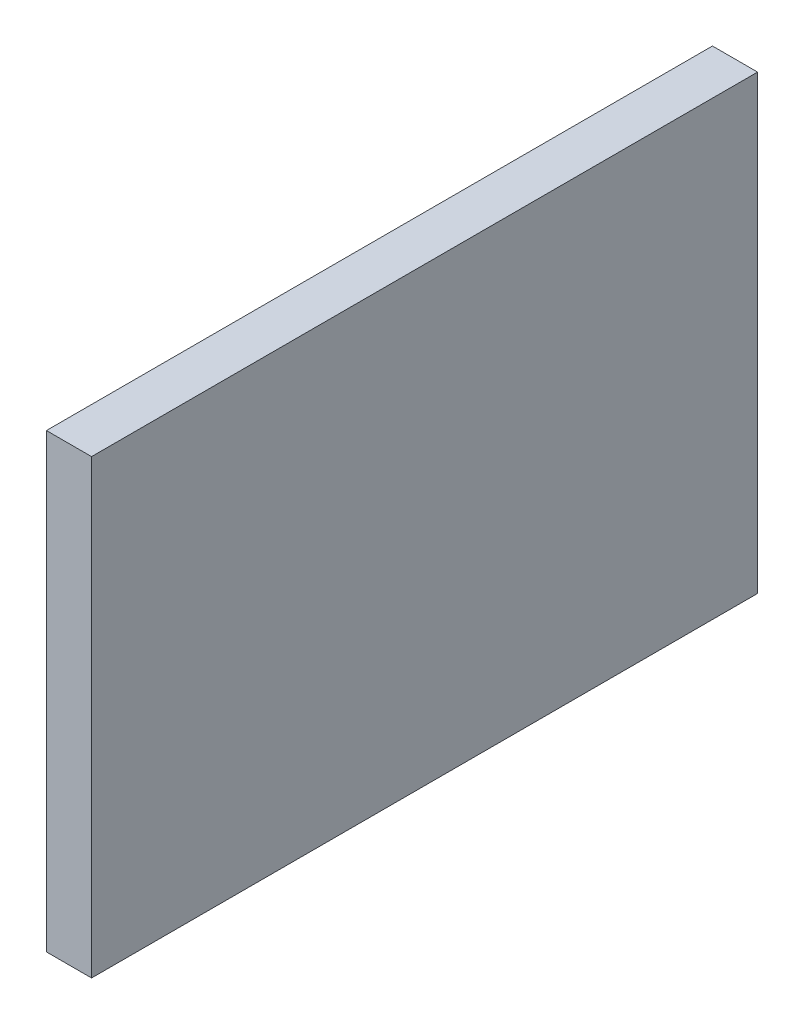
ISO-10303-21;
HEADER;
FILE_DESCRIPTION(('STEP AP214'),'2;1');
FILE_NAME('part.step','',(''),(''),'','','');
FILE_SCHEMA(('AUTOMOTIVE_DESIGN { 1 0 10303 214 1 1 1 1 }'));
ENDSEC;
DATA;
#1=APPLICATION_CONTEXT('core data for automotive mechanical design processes');
#2=APPLICATION_PROTOCOL_DEFINITION('international standard','automotive_design',2000,#1);
#3=PRODUCT_CONTEXT('',#1,'mechanical');
#4=PRODUCT('Part','Part','',(#3));
#5=PRODUCT_RELATED_PRODUCT_CATEGORY('part','',(#4));
#6=PRODUCT_DEFINITION_FORMATION('','',#4);
#7=PRODUCT_DEFINITION_CONTEXT('part definition',#1,'design');
#8=PRODUCT_DEFINITION('design','',#6,#7);
#9=PRODUCT_DEFINITION_SHAPE('','',#8);
#10=(LENGTH_UNIT() NAMED_UNIT(*) SI_UNIT(.MILLI.,.METRE.));
#11=(NAMED_UNIT(*) PLANE_ANGLE_UNIT() SI_UNIT($,.RADIAN.));
#12=(NAMED_UNIT(*) SI_UNIT($,.STERADIAN.) SOLID_ANGLE_UNIT());
#13=UNCERTAINTY_MEASURE_WITH_UNIT(LENGTH_MEASURE(1.E-05),#10,'distance_accuracy_value','');
#14=(GEOMETRIC_REPRESENTATION_CONTEXT(3) GLOBAL_UNCERTAINTY_ASSIGNED_CONTEXT((#13)) GLOBAL_UNIT_ASSIGNED_CONTEXT((#10,
#11,#12)) REPRESENTATION_CONTEXT('',''));
#15=CARTESIAN_POINT('',(0.,0.,0.));
#16=DIRECTION('',(0.,0.,1.));
#17=DIRECTION('',(1.,0.,0.));
#18=AXIS2_PLACEMENT_3D('',#15,#16,#17);
#19=CARTESIAN_POINT('',(2.,12.9107639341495,15.0863565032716));
#20=DIRECTION('',(0.,0.,-1.));
#21=DIRECTION('',(-1.,0.,0.));
#22=AXIS2_PLACEMENT_3D('',#19,#20,#21);
#23=PLANE('',#22);
#24=DIRECTION('',(0.,-1.,0.));
#25=VECTOR('',#24,1.);
#26=CARTESIAN_POINT('',(0.,12.9107639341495,15.0863565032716));
#27=LINE('',#26,#25);
#28=CARTESIAN_POINT('',(0.,12.9107639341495,15.0863565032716));
#29=VERTEX_POINT('',#28);
#30=CARTESIAN_POINT('',(0.,-7.08923606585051,15.0863565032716));
#31=VERTEX_POINT('',#30);
#32=EDGE_CURVE('E108',#29,#31,#27,.T.);
#33=ORIENTED_EDGE('',*,*,#32,.T.);
#34=DIRECTION('',(-1.,0.,0.));
#35=VECTOR('',#34,1.);
#36=CARTESIAN_POINT('',(2.,-7.08923606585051,15.0863565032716));
#37=LINE('',#36,#35);
#38=CARTESIAN_POINT('',(2.,-7.08923606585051,15.0863565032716));
#39=VERTEX_POINT('',#38);
#40=EDGE_CURVE('E11',#39,#31,#37,.T.);
#41=ORIENTED_EDGE('',*,*,#40,.F.);
#42=DIRECTION('',(0.,-1.,0.));
#43=VECTOR('',#42,1.);
#44=CARTESIAN_POINT('',(2.,12.9107639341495,15.0863565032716));
#45=LINE('',#44,#43);
#46=CARTESIAN_POINT('',(2.,12.9107639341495,15.0863565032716));
#47=VERTEX_POINT('',#46);
#48=EDGE_CURVE('E90',#47,#39,#45,.T.);
#49=ORIENTED_EDGE('',*,*,#48,.F.);
#50=DIRECTION('',(-1.,0.,0.));
#51=VECTOR('',#50,1.);
#52=CARTESIAN_POINT('',(2.,12.9107639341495,15.0863565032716));
#53=LINE('',#52,#51);
#54=EDGE_CURVE('E104',#47,#29,#53,.T.);
#55=ORIENTED_EDGE('',*,*,#54,.T.);
#56=EDGE_LOOP('',(#33,#41,#49,#55));
#57=FACE_BOUND('',#56,.T.);
#58=ADVANCED_FACE('F38',(#57),#23,.F.);
#59=CARTESIAN_POINT('',(2.,-7.08923606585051,15.0863565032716));
#60=DIRECTION('',(0.,1.,0.));
#61=DIRECTION('',(0.,0.,1.));
#62=AXIS2_PLACEMENT_3D('',#59,#60,#61);
#63=PLANE('',#62);
#64=DIRECTION('',(0.,0.,-1.));
#65=VECTOR('',#64,1.);
#66=CARTESIAN_POINT('',(0.,-7.08923606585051,15.0863565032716));
#67=LINE('',#66,#65);
#68=CARTESIAN_POINT('',(0.,-7.08923606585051,-14.4136434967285));
#69=VERTEX_POINT('',#68);
#70=EDGE_CURVE('E95',#31,#69,#67,.T.);
#71=ORIENTED_EDGE('',*,*,#70,.T.);
#72=DIRECTION('',(-1.,0.,0.));
#73=VECTOR('',#72,1.);
#74=CARTESIAN_POINT('',(2.,-7.08923606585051,-14.4136434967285));
#75=LINE('',#74,#73);
#76=CARTESIAN_POINT('',(2.,-7.08923606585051,-14.4136434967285));
#77=VERTEX_POINT('',#76);
#78=EDGE_CURVE('E47',#77,#69,#75,.T.);
#79=ORIENTED_EDGE('',*,*,#78,.F.);
#80=DIRECTION('',(0.,0.,-1.));
#81=VECTOR('',#80,1.);
#82=CARTESIAN_POINT('',(2.,-7.08923606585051,15.0863565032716));
#83=LINE('',#82,#81);
#84=EDGE_CURVE('E85',#39,#77,#83,.T.);
#85=ORIENTED_EDGE('',*,*,#84,.F.);
#86=ORIENTED_EDGE('',*,*,#40,.T.);
#87=EDGE_LOOP('',(#71,#79,#85,#86));
#88=FACE_BOUND('',#87,.T.);
#89=ADVANCED_FACE('F94',(#88),#63,.F.);
#90=CARTESIAN_POINT('',(2.,12.9107639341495,-14.4136434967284));
#91=DIRECTION('',(0.,0.,1.));
#92=DIRECTION('',(0.,-1.,0.));
#93=AXIS2_PLACEMENT_3D('',#90,#91,#92);
#94=PLANE('',#93);
#95=DIRECTION('',(0.,1.,0.));
#96=VECTOR('',#95,1.);
#97=CARTESIAN_POINT('',(0.,12.9107639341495,-14.4136434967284));
#98=LINE('',#97,#96);
#99=CARTESIAN_POINT('',(0.,12.9107639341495,-14.4136434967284));
#100=VERTEX_POINT('',#99);
#101=EDGE_CURVE('E72',#69,#100,#98,.T.);
#102=ORIENTED_EDGE('',*,*,#101,.T.);
#103=DIRECTION('',(-1.,0.,0.));
#104=VECTOR('',#103,1.);
#105=CARTESIAN_POINT('',(2.,12.9107639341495,-14.4136434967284));
#106=LINE('',#105,#104);
#107=CARTESIAN_POINT('',(2.,12.9107639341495,-14.4136434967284));
#108=VERTEX_POINT('',#107);
#109=EDGE_CURVE('E97',#108,#100,#106,.T.);
#110=ORIENTED_EDGE('',*,*,#109,.F.);
#111=DIRECTION('',(0.,1.,0.));
#112=VECTOR('',#111,1.);
#113=CARTESIAN_POINT('',(2.,12.9107639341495,-14.4136434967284));
#114=LINE('',#113,#112);
#115=EDGE_CURVE('E88',#77,#108,#114,.T.);
#116=ORIENTED_EDGE('',*,*,#115,.F.);
#117=ORIENTED_EDGE('',*,*,#78,.T.);
#118=EDGE_LOOP('',(#102,#110,#116,#117));
#119=FACE_BOUND('',#118,.T.);
#120=ADVANCED_FACE('F98',(#119),#94,.F.);
#121=CARTESIAN_POINT('',(2.,12.9107639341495,15.0863565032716));
#122=DIRECTION('',(0.,-1.,0.));
#123=DIRECTION('',(0.,0.,-1.));
#124=AXIS2_PLACEMENT_3D('',#121,#122,#123);
#125=PLANE('',#124);
#126=DIRECTION('',(0.,0.,1.));
#127=VECTOR('',#126,1.);
#128=CARTESIAN_POINT('',(0.,12.9107639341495,15.0863565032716));
#129=LINE('',#128,#127);
#130=EDGE_CURVE('E78',#100,#29,#129,.T.);
#131=ORIENTED_EDGE('',*,*,#130,.T.);
#132=ORIENTED_EDGE('',*,*,#54,.F.);
#133=DIRECTION('',(0.,0.,1.));
#134=VECTOR('',#133,1.);
#135=CARTESIAN_POINT('',(2.,12.9107639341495,15.0863565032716));
#136=LINE('',#135,#134);
#137=EDGE_CURVE('E55',#108,#47,#136,.T.);
#138=ORIENTED_EDGE('',*,*,#137,.F.);
#139=ORIENTED_EDGE('',*,*,#109,.T.);
#140=EDGE_LOOP('',(#131,#132,#138,#139));
#141=FACE_BOUND('',#140,.T.);
#142=ADVANCED_FACE('F119',(#141),#125,.F.);
#143=CARTESIAN_POINT('',(2.,0.,0.));
#144=DIRECTION('',(1.,0.,0.));
#145=DIRECTION('',(0.,0.,-1.));
#146=AXIS2_PLACEMENT_3D('',#143,#144,#145);
#147=PLANE('',#146);
#148=ORIENTED_EDGE('',*,*,#48,.T.);
#149=ORIENTED_EDGE('',*,*,#84,.T.);
#150=ORIENTED_EDGE('',*,*,#115,.T.);
#151=ORIENTED_EDGE('',*,*,#137,.T.);
#152=EDGE_LOOP('',(#148,#149,#150,#151));
#153=FACE_BOUND('',#152,.T.);
#154=ADVANCED_FACE('F86',(#153),#147,.T.);
#155=CARTESIAN_POINT('',(0.,0.,0.));
#156=DIRECTION('',(1.,0.,0.));
#157=DIRECTION('',(0.,0.,-1.));
#158=AXIS2_PLACEMENT_3D('',#155,#156,#157);
#159=PLANE('',#158);
#160=ORIENTED_EDGE('',*,*,#32,.F.);
#161=ORIENTED_EDGE('',*,*,#130,.F.);
#162=ORIENTED_EDGE('',*,*,#101,.F.);
#163=ORIENTED_EDGE('',*,*,#70,.F.);
#164=EDGE_LOOP('',(#160,#161,#162,#163));
#165=FACE_BOUND('',#164,.T.);
#166=ADVANCED_FACE('F122',(#165),#159,.F.);
#167=CLOSED_SHELL('',(#58,#89,#120,#142,#154,#166));
#168=MANIFOLD_SOLID_BREP('B2',#167);
#169=ADVANCED_BREP_SHAPE_REPRESENTATION('',(#18,#168),#14);
#170=SHAPE_DEFINITION_REPRESENTATION(#9,#169);
ENDSEC;
END-ISO-10303-21;
